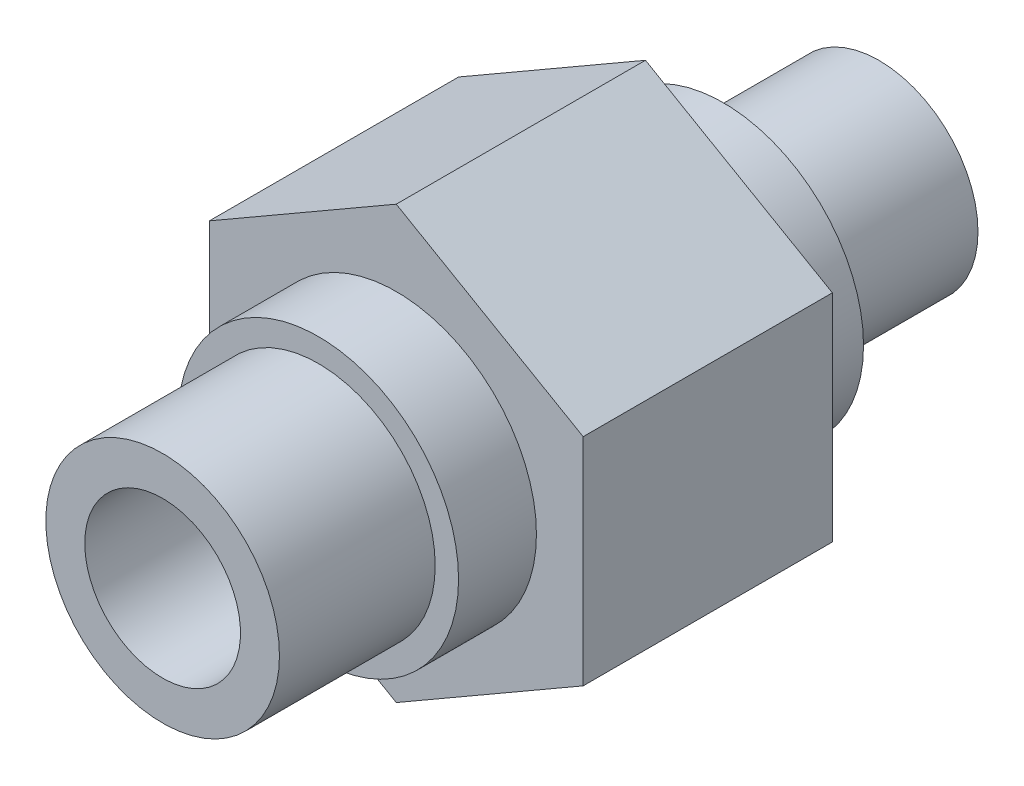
from build123d import *

# Parameters (mm, degrees)
DODANIE_WYCI_GNI_CIE1_DEPTH = 8
SZKIC2_R                    = 9
DODANIE_WYCI_GNI_CIE2_DEPTH = 5
SZKIC3_R                    = 7.5
DODANIE_WYCI_GNI_CIE3_DEPTH = 10
DODANIE_WYCI_GNI_CIE4_START = 5
SZKIC4_R                    = 9
DODANIE_WYCI_GNI_CIE4_DEPTH = 5
SZKIC5_R                    = 6.35
DODANIE_WYCI_GNI_CIE5_DEPTH = 10
SZKIC6_R                    = 5
WYTNIJ_WYCI_GNI_CIE1_DEPTH  = 50.517673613


with BuildPart() as part:
    # Szkic1 → Dodanie-wyci_gni_cie1 (new, symmetric)
    with BuildSketch(Plane.XY):
        Polygon((0, 13.856406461), (-12, 6.92820323), (-12, -6.92820323), (0, -13.856406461), (12, -6.92820323), (12, 6.92820323), align=None)
    extrude(amount=DODANIE_WYCI_GNI_CIE1_DEPTH, both=True)

    # Szkic2 → Dodanie-wyci_gni_cie2 (add)
    with BuildSketch(Plane.XY.offset(8)):
        Circle(SZKIC2_R)
    extrude(amount=DODANIE_WYCI_GNI_CIE2_DEPTH)

    # Szkic3 → Dodanie-wyci_gni_cie3 (add)
    with BuildSketch(Plane.XY.offset(13)):
        Circle(SZKIC3_R)
    extrude(amount=DODANIE_WYCI_GNI_CIE3_DEPTH)

    # Szkic4 → Dodanie-wyci_gni_cie4 (add)
    with BuildSketch(Plane(origin=(0, 0, -8), x_dir=(-1, 0, 0), z_dir=(0, 0, -1)).offset(DODANIE_WYCI_GNI_CIE4_START)):
        with Locations(Location((0, 0, 0), (0, 0, 180))):
            Circle(SZKIC4_R)
    extrude(amount=-DODANIE_WYCI_GNI_CIE4_DEPTH)

    # Szkic5 → Dodanie-wyci_gni_cie5 (add)
    with BuildSketch(Plane(origin=(0, 0, -13), x_dir=(-1, 0, 0), z_dir=(0, 0, -1))):
        Circle(SZKIC5_R)
    extrude(amount=DODANIE_WYCI_GNI_CIE5_DEPTH)

    # Szkic6 → Wytnij-wyci_gni_cie1 (cut, through all)
    with BuildSketch(Plane(origin=(0, 0, -23), x_dir=(-1, 0, 0), z_dir=(0, 0, -1))):
        Circle(SZKIC6_R)
    extrude(amount=-WYTNIJ_WYCI_GNI_CIE1_DEPTH, mode=Mode.SUBTRACT)


solid = part.part
